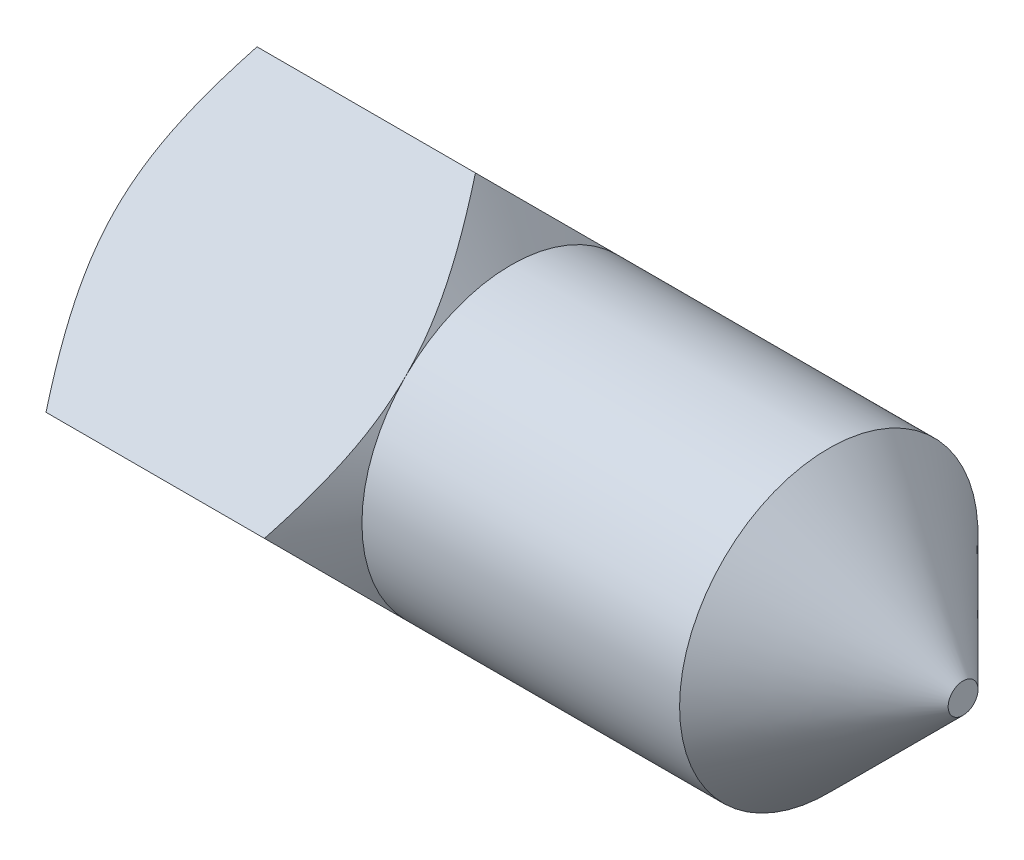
from build123d import *

# Parameters (mm, degrees)
BASEHEAD_DEPTH = 4
BODYSKE_W      = 6.53602765
BODYSKE_H      = 2


with BuildPart() as part:
    # BaseHeadSke → BaseHead (new body)
    with BuildSketch(Plane(origin=(0, 0, 0), x_dir=(0, 0, -1), z_dir=(1, 0, 0))):
        Polygon((0, 2.828427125), (2.828427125, 0), (0, -2.828427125), (-2.828427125, 0), align=None)
    extrude(amount=BASEHEAD_DEPTH)

    # HeadChamferSke → HeadChamfer (revolve, cut)
    with BuildSketch(Plane.XY, mode=Mode.PRIVATE) as headchamfer_sk:
        Polygon((0, 2.828427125), (0, 1.9), (0.53602765, 2.828427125), align=None)
        Polygon((3.46397235, 2.828427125), (4, 1.9), (4, 2.828427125), align=None)
    revolve(headchamfer_sk.sketch.rotate(Axis((0, 0, 0), (1, 0, 0)), 270), axis=Axis((0, 0, 0), (1, 0, 0)), mode=Mode.SUBTRACT)

    # BodySke → BaseBody (revolve)
    with BuildSketch(Plane.XY, mode=Mode.PRIVATE) as basebody_sk:
        with Locations((6.731986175, 1)):
            Rectangle(BODYSKE_W, BODYSKE_H)
    revolve(basebody_sk.sketch.rotate(Axis((0, 0, 0), (1, 0, 0)), 90), axis=Axis((0, 0, 0), (1, 0, 0)))

    # ChamferEndSke → ChamferEnd (revolve, cut)
    with BuildSketch(Plane.XY, mode=Mode.PRIVATE) as chamferend_sk:
        Polygon((10, 2), (10, 0.2), (8.2, 2), align=None)
    revolve(chamferend_sk.sketch.rotate(Axis((0, 0, 0), (1, 0, 0)), 90), axis=Axis((0, 0, 0), (1, 0, 0)), mode=Mode.SUBTRACT)


solid = part.part
